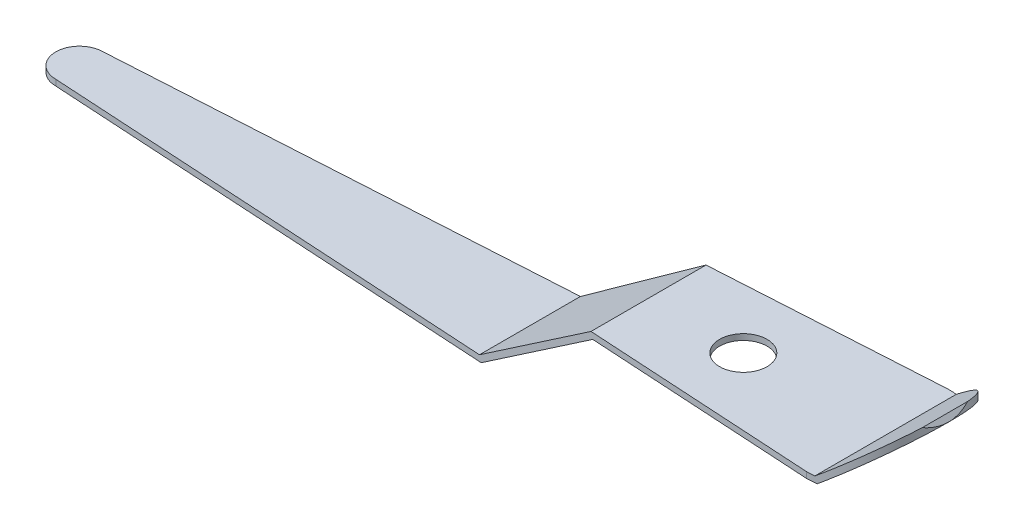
from build123d import *

# Parameters (mm, degrees)
EXTRUSION1_DEPTH             = 12
ENL_V_MAT_EXTRU_1_DEPTH      = 12
ENL_V_MAT_EXTRU_1_DEPTH_BACK = 12
ESQUISSE2_OUTSIDE_W          = 92.736
ESQUISSE2_OUTSIDE_H          = 29.424
ESQUISSE3_R                  = 2
ENL_V_MAT_EXTRU_2_DEPTH      = 77.630279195


with BuildPart() as part:
    # Esquisse1 → Extrusion1 (new body)
    with BuildSketch(Plane.XY):
        Polygon((0, 0), (40, 0), (50, 7), (70, 7), (75, 11), (75.312347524, 10.609565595), (70.17539053, 6.5), (50.157611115, 6.5), (40.157611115, -0.5), (0, -0.5), align=None)
    extrude(amount=EXTRUSION1_DEPTH)

    # Esquisse2 outside → Enl_v. mat.-Extru.1 (cut, two sides: drawn at the far end of the back side and taken through both)
    with BuildSketch(Plane(origin=(0, 0, 0), x_dir=(1, 0, 0), z_dir=(0, 1, 0)).offset(-ENL_V_MAT_EXTRU_1_DEPTH_BACK)):
        with Locations((37.656, -6)):
            Rectangle(ESQUISSE2_OUTSIDE_W, ESQUISSE2_OUTSIDE_H)
        with BuildLine():
            Line((2, -4), (69.312347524, 0))
            ThreePointArc((69.312347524, 0), (75.312347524, -6), (69.312347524, -12))
            Line((69.312347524, -12), (2, -8))
            ThreePointArc((2, -8), (0, -6), (2, -4))
        make_face(mode=Mode.SUBTRACT)
    extrude(amount=ENL_V_MAT_EXTRU_1_DEPTH + ENL_V_MAT_EXTRU_1_DEPTH_BACK, mode=Mode.SUBTRACT)

    # Esquisse3 → Enl_v. mat.-Extru.2 (cut, through all)
    with BuildSketch(Plane(origin=(0, 7, 0), x_dir=(-1, 0, 0), z_dir=(0, 1, 0))):
        with Locations(Location((-58, 6, 0), (0, 0, 90))):
            Circle(ESQUISSE3_R)
    extrude(amount=-ENL_V_MAT_EXTRU_2_DEPTH, mode=Mode.SUBTRACT)


solid = part.part
